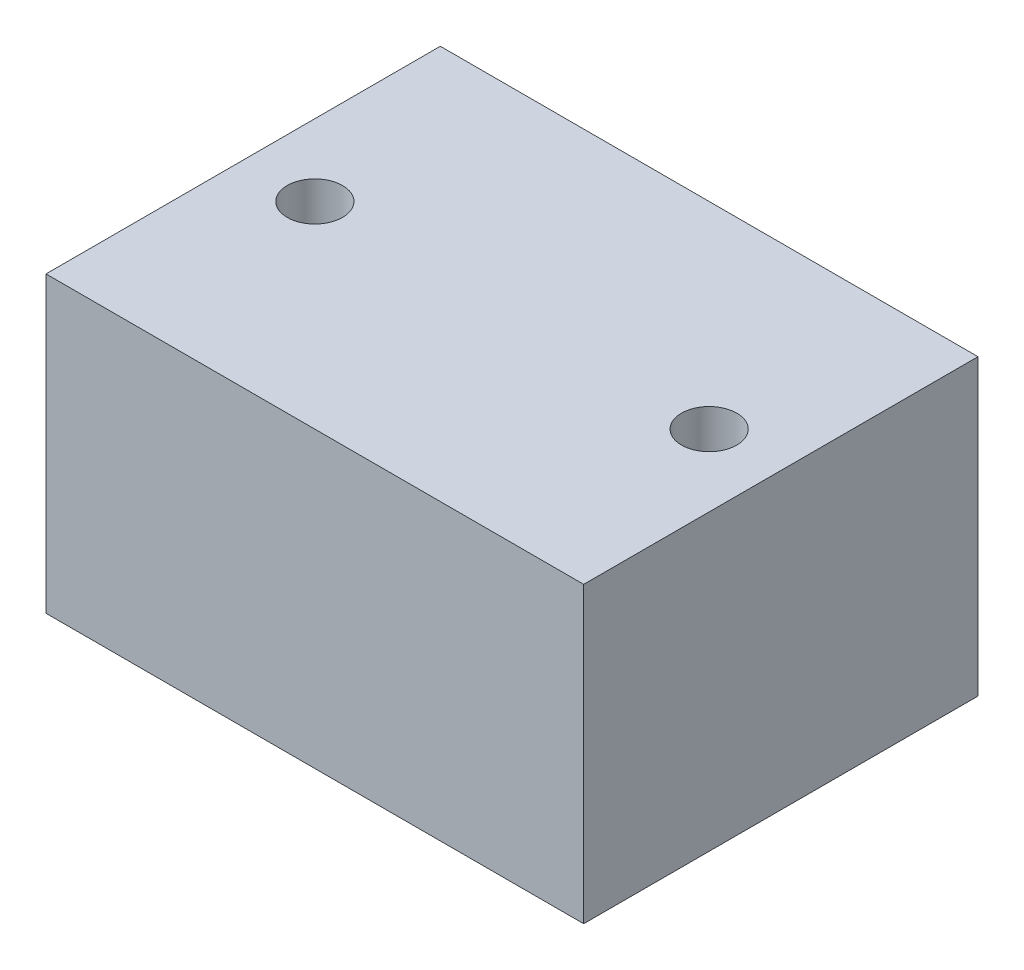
from build123d import *

# Parameters (mm, degrees)
SKETCH1_W                = 95.25
SKETCH1_H                = 52.07
BOSS_EXTRUDE1_DEPTH      = 34.925
W_0_386_DIAMETER_HOLE1_D = 9.8044


with BuildPart() as part:
    # Sketch1 → Boss-Extrude1 (new, symmetric)
    with BuildSketch(Plane.XY):
        Rectangle(SKETCH1_W, SKETCH1_H)
    extrude(amount=BOSS_EXTRUDE1_DEPTH, both=True)

    # W _0.386_ Diameter Hole1 (through all)
    with Locations(Plane(origin=(0, 26.035, 0), x_dir=(1, 0, 0), z_dir=(0, 1, 0))):
        with Locations((-34.925, 0), (34.925, 0)):
            Hole(W_0_386_DIAMETER_HOLE1_D / 2)


solid = part.part
